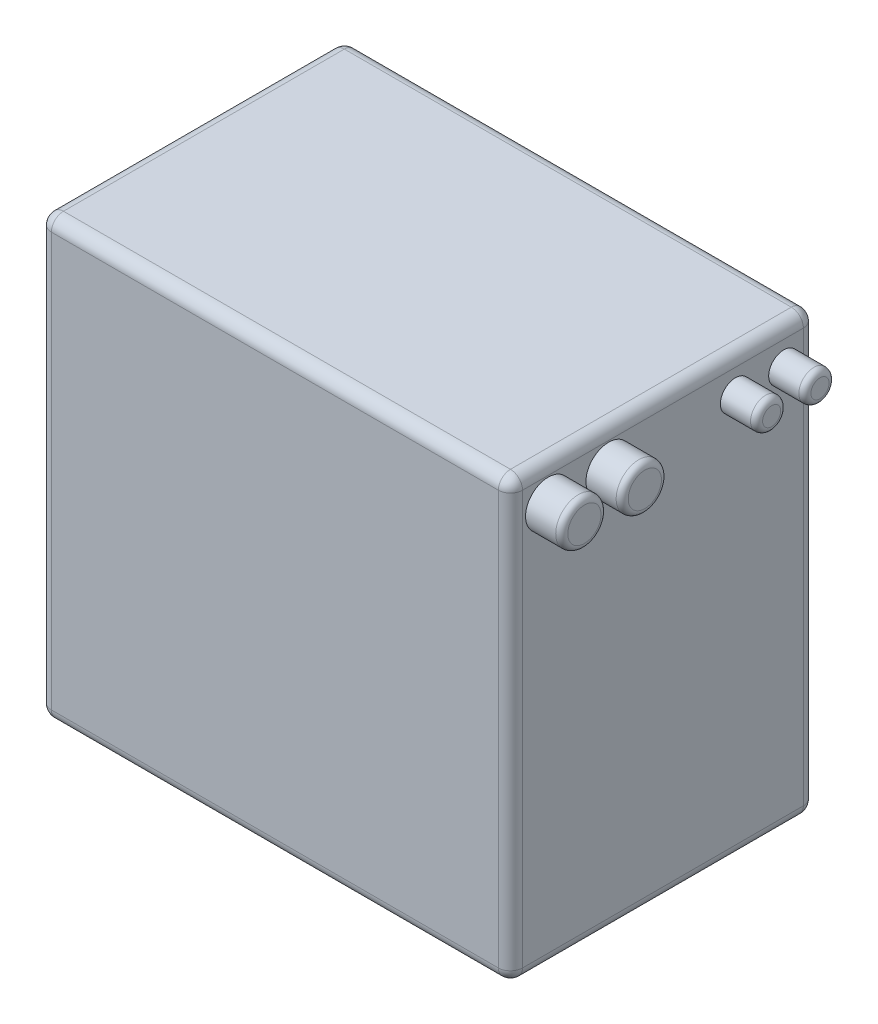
ISO-10303-21;
HEADER;
FILE_DESCRIPTION(('STEP AP214'),'2;1');
FILE_NAME('part.step','',(''),(''),'','','');
FILE_SCHEMA(('AUTOMOTIVE_DESIGN { 1 0 10303 214 1 1 1 1 }'));
ENDSEC;
DATA;
#1=APPLICATION_CONTEXT('core data for automotive mechanical design processes');
#2=APPLICATION_PROTOCOL_DEFINITION('international standard','automotive_design',2000,#1);
#3=PRODUCT_CONTEXT('',#1,'mechanical');
#4=PRODUCT('Part','Part','',(#3));
#5=PRODUCT_RELATED_PRODUCT_CATEGORY('part','',(#4));
#6=PRODUCT_DEFINITION_FORMATION('','',#4);
#7=PRODUCT_DEFINITION_CONTEXT('part definition',#1,'design');
#8=PRODUCT_DEFINITION('design','',#6,#7);
#9=PRODUCT_DEFINITION_SHAPE('','',#8);
#10=(LENGTH_UNIT() NAMED_UNIT(*) SI_UNIT(.MILLI.,.METRE.));
#11=(NAMED_UNIT(*) PLANE_ANGLE_UNIT() SI_UNIT($,.RADIAN.));
#12=(NAMED_UNIT(*) SI_UNIT($,.STERADIAN.) SOLID_ANGLE_UNIT());
#13=UNCERTAINTY_MEASURE_WITH_UNIT(LENGTH_MEASURE(1.E-05),#10,'distance_accuracy_value','');
#14=(GEOMETRIC_REPRESENTATION_CONTEXT(3) GLOBAL_UNCERTAINTY_ASSIGNED_CONTEXT((#13)) GLOBAL_UNIT_ASSIGNED_CONTEXT((#10,
#11,#12)) REPRESENTATION_CONTEXT('',''));
#15=CARTESIAN_POINT('',(0.,0.,0.));
#16=DIRECTION('',(0.,0.,1.));
#17=DIRECTION('',(1.,0.,0.));
#18=AXIS2_PLACEMENT_3D('',#15,#16,#17);
#19=CARTESIAN_POINT('',(266.7,211.1248,60.325));
#20=DIRECTION('',(-1.,0.,0.));
#21=DIRECTION('',(0.,0.,1.));
#22=AXIS2_PLACEMENT_3D('',#19,#20,#21);
#23=CYLINDRICAL_SURFACE('',#22,11.9126);
#24=CARTESIAN_POINT('',(263.525,211.1248,60.325));
#25=DIRECTION('',(1.,0.,0.));
#26=DIRECTION('',(0.,0.,-1.));
#27=AXIS2_PLACEMENT_3D('',#24,#25,#26);
#28=CIRCLE('',#27,11.9126);
#29=CARTESIAN_POINT('',(263.525,211.1248,72.2376));
#30=VERTEX_POINT('',#29);
#31=EDGE_CURVE('E11',#30,#30,#28,.F.);
#32=CARTESIAN_POINT('',(247.65,211.1248,60.325));
#33=DIRECTION('',(1.,0.,0.));
#34=DIRECTION('',(0.,0.,-1.));
#35=AXIS2_PLACEMENT_3D('',#32,#33,#34);
#36=CIRCLE('',#35,11.9126);
#37=CARTESIAN_POINT('',(247.65,211.1248,72.2376));
#38=VERTEX_POINT('',#37);
#39=EDGE_CURVE('E53',#38,#38,#36,.T.);
#40=CARTESIAN_POINT('',(263.525,211.1248,72.2376));
#41=CARTESIAN_POINT('',(263.359635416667,211.1248,72.2376));
#42=CARTESIAN_POINT('',(263.194270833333,211.1248,72.2376));
#43=CARTESIAN_POINT('',(262.863541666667,211.1248,72.2376));
#44=CARTESIAN_POINT('',(262.698177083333,211.1248,72.2376));
#45=CARTESIAN_POINT('',(262.367447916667,211.1248,72.2376));
#46=CARTESIAN_POINT('',(262.202083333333,211.1248,72.2376));
#47=CARTESIAN_POINT('',(261.871354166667,211.1248,72.2376));
#48=CARTESIAN_POINT('',(261.705989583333,211.1248,72.2376));
#49=CARTESIAN_POINT('',(261.375260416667,211.1248,72.2376));
#50=CARTESIAN_POINT('',(261.209895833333,211.1248,72.2376));
#51=CARTESIAN_POINT('',(260.879166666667,211.1248,72.2376));
#52=CARTESIAN_POINT('',(260.713802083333,211.1248,72.2376));
#53=CARTESIAN_POINT('',(260.383072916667,211.1248,72.2376));
#54=CARTESIAN_POINT('',(260.217708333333,211.1248,72.2376));
#55=CARTESIAN_POINT('',(259.886979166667,211.1248,72.2376));
#56=CARTESIAN_POINT('',(259.721614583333,211.1248,72.2376));
#57=CARTESIAN_POINT('',(259.390885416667,211.1248,72.2376));
#58=CARTESIAN_POINT('',(259.225520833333,211.1248,72.2376));
#59=CARTESIAN_POINT('',(258.894791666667,211.1248,72.2376));
#60=CARTESIAN_POINT('',(258.729427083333,211.1248,72.2376));
#61=CARTESIAN_POINT('',(258.398697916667,211.1248,72.2376));
#62=CARTESIAN_POINT('',(258.233333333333,211.1248,72.2376));
#63=CARTESIAN_POINT('',(257.902604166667,211.1248,72.2376));
#64=CARTESIAN_POINT('',(257.737239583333,211.1248,72.2376));
#65=CARTESIAN_POINT('',(257.406510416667,211.1248,72.2376));
#66=CARTESIAN_POINT('',(257.241145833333,211.1248,72.2376));
#67=CARTESIAN_POINT('',(256.910416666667,211.1248,72.2376));
#68=CARTESIAN_POINT('',(256.745052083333,211.1248,72.2376));
#69=CARTESIAN_POINT('',(256.414322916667,211.1248,72.2376));
#70=CARTESIAN_POINT('',(256.248958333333,211.1248,72.2376));
#71=CARTESIAN_POINT('',(255.918229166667,211.1248,72.2376));
#72=CARTESIAN_POINT('',(255.752864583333,211.1248,72.2376));
#73=CARTESIAN_POINT('',(255.422135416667,211.1248,72.2376));
#74=CARTESIAN_POINT('',(255.256770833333,211.1248,72.2376));
#75=CARTESIAN_POINT('',(254.926041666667,211.1248,72.2376));
#76=CARTESIAN_POINT('',(254.760677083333,211.1248,72.2376));
#77=CARTESIAN_POINT('',(254.429947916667,211.1248,72.2376));
#78=CARTESIAN_POINT('',(254.264583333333,211.1248,72.2376));
#79=CARTESIAN_POINT('',(253.933854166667,211.1248,72.2376));
#80=CARTESIAN_POINT('',(253.768489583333,211.1248,72.2376));
#81=CARTESIAN_POINT('',(253.437760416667,211.1248,72.2376));
#82=CARTESIAN_POINT('',(253.272395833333,211.1248,72.2376));
#83=CARTESIAN_POINT('',(252.941666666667,211.1248,72.2376));
#84=CARTESIAN_POINT('',(252.776302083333,211.1248,72.2376));
#85=CARTESIAN_POINT('',(252.445572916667,211.1248,72.2376));
#86=CARTESIAN_POINT('',(252.280208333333,211.1248,72.2376));
#87=CARTESIAN_POINT('',(251.949479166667,211.1248,72.2376));
#88=CARTESIAN_POINT('',(251.784114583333,211.1248,72.2376));
#89=CARTESIAN_POINT('',(251.453385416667,211.1248,72.2376));
#90=CARTESIAN_POINT('',(251.288020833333,211.1248,72.2376));
#91=CARTESIAN_POINT('',(250.957291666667,211.1248,72.2376));
#92=CARTESIAN_POINT('',(250.791927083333,211.1248,72.2376));
#93=CARTESIAN_POINT('',(250.461197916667,211.1248,72.2376));
#94=CARTESIAN_POINT('',(250.295833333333,211.1248,72.2376));
#95=CARTESIAN_POINT('',(249.965104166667,211.1248,72.2376));
#96=CARTESIAN_POINT('',(249.799739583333,211.1248,72.2376));
#97=CARTESIAN_POINT('',(249.469010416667,211.1248,72.2376));
#98=CARTESIAN_POINT('',(249.303645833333,211.1248,72.2376));
#99=CARTESIAN_POINT('',(248.972916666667,211.1248,72.2376));
#100=CARTESIAN_POINT('',(248.807552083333,211.1248,72.2376));
#101=CARTESIAN_POINT('',(248.476822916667,211.1248,72.2376));
#102=CARTESIAN_POINT('',(248.311458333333,211.1248,72.2376));
#103=CARTESIAN_POINT('',(247.980729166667,211.1248,72.2376));
#104=CARTESIAN_POINT('',(247.815364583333,211.1248,72.2376));
#105=CARTESIAN_POINT('',(247.65,211.1248,72.2376));
#106=B_SPLINE_CURVE_WITH_KNOTS('',3,(#40,#41,#42,#43,#44,#45,#46,#47,#48,#49,#50,#51,#52,#53,
#54,#55,#56,#57,#58,#59,#60,#61,#62,#63,#64,#65,#66,#67,#68,#69,#70,#71,#72,#73,#74,#75,#76,#77,
#78,#79,#80,#81,#82,#83,#84,#85,#86,#87,#88,#89,#90,#91,#92,#93,#94,#95,#96,#97,#98,#99,#100,
#101,#102,#103,#104,#105),.UNSPECIFIED.,.F.,.F.,(4,2,2,2,2,2,2,2,2,2,2,2,2,2,2,2,2,2,2,2,2,2,2,
2,2,2,2,2,2,2,2,2,4),(0.,0.496093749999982,0.992187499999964,1.48828125,1.98437499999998,
2.48046874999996,2.9765625,3.47265624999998,3.96874999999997,4.46484375,4.96093749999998,
5.45703124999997,5.953125,6.44921874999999,6.94531249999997,7.44140625,7.93749999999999,
8.43359374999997,8.92968750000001,9.42578124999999,9.92187499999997,10.41796875,10.9140625,
11.41015625,11.90625,12.40234375,12.8984375,13.39453125,13.890625,14.38671875,14.8828125,
15.37890625,15.875),.UNSPECIFIED.);
#107=EDGE_CURVE('BSEAM42',#30,#38,#106,.T.);
#108=ORIENTED_EDGE('',*,*,#31,.T.);
#109=ORIENTED_EDGE('',*,*,#39,.T.);
#110=ORIENTED_EDGE('',*,*,#107,.T.);
#111=ORIENTED_EDGE('',*,*,#107,.F.);
#112=EDGE_LOOP('',(#108,#110,#109,#111));
#113=FACE_BOUND('',#112,.T.);
#114=ADVANCED_FACE('F42',(#113),#23,.T.);
#115=CARTESIAN_POINT('',(266.7,211.1248,60.325));
#116=DIRECTION('',(1.,0.,0.));
#117=DIRECTION('',(0.,0.,-1.));
#118=AXIS2_PLACEMENT_3D('',#115,#116,#117);
#119=PLANE('',#118);
#120=CARTESIAN_POINT('',(266.7,211.1248,60.325));
#121=DIRECTION('',(1.,0.,0.));
#122=DIRECTION('',(0.,0.,-1.));
#123=AXIS2_PLACEMENT_3D('',#120,#121,#122);
#124=CIRCLE('',#123,8.73760000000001);
#125=CARTESIAN_POINT('',(266.7,211.1248,51.5874));
#126=VERTEX_POINT('',#125);
#127=EDGE_CURVE('E49',#126,#126,#124,.T.);
#128=ORIENTED_EDGE('',*,*,#127,.T.);
#129=EDGE_LOOP('',(#128));
#130=FACE_BOUND('',#129,.T.);
#131=ADVANCED_FACE('F63',(#130),#119,.T.);
#132=CARTESIAN_POINT('',(247.65,211.1248,60.325));
#133=DIRECTION('',(1.,0.,0.));
#134=DIRECTION('',(0.,0.,-1.));
#135=AXIS2_PLACEMENT_3D('',#132,#133,#134);
#136=PLANE('',#135);
#137=ORIENTED_EDGE('',*,*,#39,.F.);
#138=EDGE_LOOP('',(#137));
#139=FACE_BOUND('',#138,.T.);
#140=ADVANCED_FACE('F61',(#139),#136,.F.);
#141=CARTESIAN_POINT('',(263.525,211.1248,60.325));
#142=DIRECTION('',(1.,0.,0.));
#143=DIRECTION('',(0.,0.,-1.));
#144=AXIS2_PLACEMENT_3D('',#141,#142,#143);
#145=TOROIDAL_SURFACE('',#144,8.73760000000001,3.175);
#146=ORIENTED_EDGE('',*,*,#31,.F.);
#147=EDGE_LOOP('',(#146));
#148=FACE_BOUND('',#147,.T.);
#149=ORIENTED_EDGE('',*,*,#127,.F.);
#150=EDGE_LOOP('',(#149));
#151=FACE_BOUND('',#150,.T.);
#152=ADVANCED_FACE('F44',(#148,#151),#145,.T.);
#153=CLOSED_SHELL('',(#114,#131,#140,#152));
#154=MANIFOLD_SOLID_BREP('B2',#153);
#155=CARTESIAN_POINT('',(266.7,211.1248,28.575));
#156=DIRECTION('',(-1.,0.,0.));
#157=DIRECTION('',(0.,0.,1.));
#158=AXIS2_PLACEMENT_3D('',#155,#156,#157);
#159=CYLINDRICAL_SURFACE('',#158,11.9126);
#160=CARTESIAN_POINT('',(263.525,211.1248,28.575));
#161=DIRECTION('',(1.,0.,0.));
#162=DIRECTION('',(0.,0.,-1.));
#163=AXIS2_PLACEMENT_3D('',#160,#161,#162);
#164=CIRCLE('',#163,11.9126);
#165=CARTESIAN_POINT('',(263.525,211.1248,40.4876));
#166=VERTEX_POINT('',#165);
#167=EDGE_CURVE('E41',#166,#166,#164,.F.);
#168=CARTESIAN_POINT('',(247.65,211.1248,28.575));
#169=DIRECTION('',(1.,0.,0.));
#170=DIRECTION('',(0.,0.,-1.));
#171=AXIS2_PLACEMENT_3D('',#168,#169,#170);
#172=CIRCLE('',#171,11.9126);
#173=CARTESIAN_POINT('',(247.65,211.1248,40.4876));
#174=VERTEX_POINT('',#173);
#175=EDGE_CURVE('E129',#174,#174,#172,.T.);
#176=CARTESIAN_POINT('',(263.525,211.1248,40.4876));
#177=CARTESIAN_POINT('',(263.359635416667,211.1248,40.4876));
#178=CARTESIAN_POINT('',(263.194270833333,211.1248,40.4876));
#179=CARTESIAN_POINT('',(262.863541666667,211.1248,40.4876));
#180=CARTESIAN_POINT('',(262.698177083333,211.1248,40.4876));
#181=CARTESIAN_POINT('',(262.367447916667,211.1248,40.4876));
#182=CARTESIAN_POINT('',(262.202083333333,211.1248,40.4876));
#183=CARTESIAN_POINT('',(261.871354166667,211.1248,40.4876));
#184=CARTESIAN_POINT('',(261.705989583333,211.1248,40.4876));
#185=CARTESIAN_POINT('',(261.375260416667,211.1248,40.4876));
#186=CARTESIAN_POINT('',(261.209895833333,211.1248,40.4876));
#187=CARTESIAN_POINT('',(260.879166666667,211.1248,40.4876));
#188=CARTESIAN_POINT('',(260.713802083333,211.1248,40.4876));
#189=CARTESIAN_POINT('',(260.383072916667,211.1248,40.4876));
#190=CARTESIAN_POINT('',(260.217708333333,211.1248,40.4876));
#191=CARTESIAN_POINT('',(259.886979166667,211.1248,40.4876));
#192=CARTESIAN_POINT('',(259.721614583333,211.1248,40.4876));
#193=CARTESIAN_POINT('',(259.390885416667,211.1248,40.4876));
#194=CARTESIAN_POINT('',(259.225520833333,211.1248,40.4876));
#195=CARTESIAN_POINT('',(258.894791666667,211.1248,40.4876));
#196=CARTESIAN_POINT('',(258.729427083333,211.1248,40.4876));
#197=CARTESIAN_POINT('',(258.398697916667,211.1248,40.4876));
#198=CARTESIAN_POINT('',(258.233333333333,211.1248,40.4876));
#199=CARTESIAN_POINT('',(257.902604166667,211.1248,40.4876));
#200=CARTESIAN_POINT('',(257.737239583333,211.1248,40.4876));
#201=CARTESIAN_POINT('',(257.406510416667,211.1248,40.4876));
#202=CARTESIAN_POINT('',(257.241145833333,211.1248,40.4876));
#203=CARTESIAN_POINT('',(256.910416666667,211.1248,40.4876));
#204=CARTESIAN_POINT('',(256.745052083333,211.1248,40.4876));
#205=CARTESIAN_POINT('',(256.414322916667,211.1248,40.4876));
#206=CARTESIAN_POINT('',(256.248958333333,211.1248,40.4876));
#207=CARTESIAN_POINT('',(255.918229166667,211.1248,40.4876));
#208=CARTESIAN_POINT('',(255.752864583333,211.1248,40.4876));
#209=CARTESIAN_POINT('',(255.422135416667,211.1248,40.4876));
#210=CARTESIAN_POINT('',(255.256770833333,211.1248,40.4876));
#211=CARTESIAN_POINT('',(254.926041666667,211.1248,40.4876));
#212=CARTESIAN_POINT('',(254.760677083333,211.1248,40.4876));
#213=CARTESIAN_POINT('',(254.429947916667,211.1248,40.4876));
#214=CARTESIAN_POINT('',(254.264583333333,211.1248,40.4876));
#215=CARTESIAN_POINT('',(253.933854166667,211.1248,40.4876));
#216=CARTESIAN_POINT('',(253.768489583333,211.1248,40.4876));
#217=CARTESIAN_POINT('',(253.437760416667,211.1248,40.4876));
#218=CARTESIAN_POINT('',(253.272395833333,211.1248,40.4876));
#219=CARTESIAN_POINT('',(252.941666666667,211.1248,40.4876));
#220=CARTESIAN_POINT('',(252.776302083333,211.1248,40.4876));
#221=CARTESIAN_POINT('',(252.445572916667,211.1248,40.4876));
#222=CARTESIAN_POINT('',(252.280208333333,211.1248,40.4876));
#223=CARTESIAN_POINT('',(251.949479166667,211.1248,40.4876));
#224=CARTESIAN_POINT('',(251.784114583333,211.1248,40.4876));
#225=CARTESIAN_POINT('',(251.453385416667,211.1248,40.4876));
#226=CARTESIAN_POINT('',(251.288020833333,211.1248,40.4876));
#227=CARTESIAN_POINT('',(250.957291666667,211.1248,40.4876));
#228=CARTESIAN_POINT('',(250.791927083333,211.1248,40.4876));
#229=CARTESIAN_POINT('',(250.461197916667,211.1248,40.4876));
#230=CARTESIAN_POINT('',(250.295833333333,211.1248,40.4876));
#231=CARTESIAN_POINT('',(249.965104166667,211.1248,40.4876));
#232=CARTESIAN_POINT('',(249.799739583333,211.1248,40.4876));
#233=CARTESIAN_POINT('',(249.469010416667,211.1248,40.4876));
#234=CARTESIAN_POINT('',(249.303645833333,211.1248,40.4876));
#235=CARTESIAN_POINT('',(248.972916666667,211.1248,40.4876));
#236=CARTESIAN_POINT('',(248.807552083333,211.1248,40.4876));
#237=CARTESIAN_POINT('',(248.476822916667,211.1248,40.4876));
#238=CARTESIAN_POINT('',(248.311458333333,211.1248,40.4876));
#239=CARTESIAN_POINT('',(247.980729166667,211.1248,40.4876));
#240=CARTESIAN_POINT('',(247.815364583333,211.1248,40.4876));
#241=CARTESIAN_POINT('',(247.65,211.1248,40.4876));
#242=B_SPLINE_CURVE_WITH_KNOTS('',3,(#176,#177,#178,#179,#180,#181,#182,#183,#184,#185,#186,
#187,#188,#189,#190,#191,#192,#193,#194,#195,#196,#197,#198,#199,#200,#201,#202,#203,#204,#205,
#206,#207,#208,#209,#210,#211,#212,#213,#214,#215,#216,#217,#218,#219,#220,#221,#222,#223,#224,
#225,#226,#227,#228,#229,#230,#231,#232,#233,#234,#235,#236,#237,#238,#239,#240,#241),
.UNSPECIFIED.,.F.,.F.,(4,2,2,2,2,2,2,2,2,2,2,2,2,2,2,2,2,2,2,2,2,2,2,2,2,2,2,2,2,2,2,2,4),(0.,
0.496093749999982,0.992187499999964,1.48828125,1.98437499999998,2.48046874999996,2.9765625,
3.47265624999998,3.96874999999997,4.46484375,4.96093749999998,5.45703124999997,5.953125,
6.44921874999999,6.94531249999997,7.44140625,7.93749999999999,8.43359374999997,8.92968750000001,
9.42578124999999,9.92187499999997,10.41796875,10.9140625,11.41015625,11.90625,12.40234375,
12.8984375,13.39453125,13.890625,14.38671875,14.8828125,15.37890625,15.875),.UNSPECIFIED.);
#243=EDGE_CURVE('BSEAM118',#166,#174,#242,.T.);
#244=ORIENTED_EDGE('',*,*,#167,.T.);
#245=ORIENTED_EDGE('',*,*,#175,.T.);
#246=ORIENTED_EDGE('',*,*,#243,.T.);
#247=ORIENTED_EDGE('',*,*,#243,.F.);
#248=EDGE_LOOP('',(#244,#246,#245,#247));
#249=FACE_BOUND('',#248,.T.);
#250=ADVANCED_FACE('F118',(#249),#159,.T.);
#251=CARTESIAN_POINT('',(266.7,211.1248,28.575));
#252=DIRECTION('',(1.,0.,0.));
#253=DIRECTION('',(0.,0.,-1.));
#254=AXIS2_PLACEMENT_3D('',#251,#252,#253);
#255=PLANE('',#254);
#256=CARTESIAN_POINT('',(266.7,211.1248,28.575));
#257=DIRECTION('',(1.,0.,0.));
#258=DIRECTION('',(0.,0.,-1.));
#259=AXIS2_PLACEMENT_3D('',#256,#257,#258);
#260=CIRCLE('',#259,8.73760000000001);
#261=CARTESIAN_POINT('',(266.7,211.1248,19.8374));
#262=VERTEX_POINT('',#261);
#263=EDGE_CURVE('E125',#262,#262,#260,.T.);
#264=ORIENTED_EDGE('',*,*,#263,.T.);
#265=EDGE_LOOP('',(#264));
#266=FACE_BOUND('',#265,.T.);
#267=ADVANCED_FACE('F139',(#266),#255,.T.);
#268=CARTESIAN_POINT('',(247.65,211.1248,28.575));
#269=DIRECTION('',(1.,0.,0.));
#270=DIRECTION('',(0.,0.,-1.));
#271=AXIS2_PLACEMENT_3D('',#268,#269,#270);
#272=PLANE('',#271);
#273=ORIENTED_EDGE('',*,*,#175,.F.);
#274=EDGE_LOOP('',(#273));
#275=FACE_BOUND('',#274,.T.);
#276=ADVANCED_FACE('F137',(#275),#272,.F.);
#277=CARTESIAN_POINT('',(263.525,211.1248,28.575));
#278=DIRECTION('',(1.,0.,0.));
#279=DIRECTION('',(0.,0.,-1.));
#280=AXIS2_PLACEMENT_3D('',#277,#278,#279);
#281=TOROIDAL_SURFACE('',#280,8.73760000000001,3.175);
#282=ORIENTED_EDGE('',*,*,#167,.F.);
#283=EDGE_LOOP('',(#282));
#284=FACE_BOUND('',#283,.T.);
#285=ORIENTED_EDGE('',*,*,#263,.F.);
#286=EDGE_LOOP('',(#285));
#287=FACE_BOUND('',#286,.T.);
#288=ADVANCED_FACE('F120',(#284,#287),#281,.T.);
#289=CLOSED_SHELL('',(#250,#267,#276,#288));
#290=MANIFOLD_SOLID_BREP('B6',#289);
#291=CARTESIAN_POINT('',(266.7,211.1248,-38.1));
#292=DIRECTION('',(-1.,0.,0.));
#293=DIRECTION('',(0.,0.,1.));
#294=AXIS2_PLACEMENT_3D('',#291,#292,#293);
#295=CYLINDRICAL_SURFACE('',#294,7.9375);
#296=CARTESIAN_POINT('',(263.525,211.1248,-38.1));
#297=DIRECTION('',(1.,0.,0.));
#298=DIRECTION('',(0.,0.,-1.));
#299=AXIS2_PLACEMENT_3D('',#296,#297,#298);
#300=CIRCLE('',#299,7.9375);
#301=CARTESIAN_POINT('',(263.525,211.1248,-30.1625));
#302=VERTEX_POINT('',#301);
#303=EDGE_CURVE('E117',#302,#302,#300,.F.);
#304=CARTESIAN_POINT('',(247.65,211.1248,-38.1));
#305=DIRECTION('',(1.,0.,0.));
#306=DIRECTION('',(0.,0.,-1.));
#307=AXIS2_PLACEMENT_3D('',#304,#305,#306);
#308=CIRCLE('',#307,7.9375);
#309=CARTESIAN_POINT('',(247.65,211.1248,-30.1625));
#310=VERTEX_POINT('',#309);
#311=EDGE_CURVE('E205',#310,#310,#308,.T.);
#312=CARTESIAN_POINT('',(263.525,211.1248,-30.1625));
#313=CARTESIAN_POINT('',(263.359635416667,211.1248,-30.1625));
#314=CARTESIAN_POINT('',(263.194270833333,211.1248,-30.1625));
#315=CARTESIAN_POINT('',(262.863541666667,211.1248,-30.1625));
#316=CARTESIAN_POINT('',(262.698177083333,211.1248,-30.1625));
#317=CARTESIAN_POINT('',(262.367447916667,211.1248,-30.1625));
#318=CARTESIAN_POINT('',(262.202083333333,211.1248,-30.1625));
#319=CARTESIAN_POINT('',(261.871354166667,211.1248,-30.1625));
#320=CARTESIAN_POINT('',(261.705989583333,211.1248,-30.1625));
#321=CARTESIAN_POINT('',(261.375260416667,211.1248,-30.1625));
#322=CARTESIAN_POINT('',(261.209895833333,211.1248,-30.1625));
#323=CARTESIAN_POINT('',(260.879166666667,211.1248,-30.1625));
#324=CARTESIAN_POINT('',(260.713802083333,211.1248,-30.1625));
#325=CARTESIAN_POINT('',(260.383072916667,211.1248,-30.1625));
#326=CARTESIAN_POINT('',(260.217708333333,211.1248,-30.1625));
#327=CARTESIAN_POINT('',(259.886979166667,211.1248,-30.1625));
#328=CARTESIAN_POINT('',(259.721614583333,211.1248,-30.1625));
#329=CARTESIAN_POINT('',(259.390885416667,211.1248,-30.1625));
#330=CARTESIAN_POINT('',(259.225520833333,211.1248,-30.1625));
#331=CARTESIAN_POINT('',(258.894791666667,211.1248,-30.1625));
#332=CARTESIAN_POINT('',(258.729427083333,211.1248,-30.1625));
#333=CARTESIAN_POINT('',(258.398697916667,211.1248,-30.1625));
#334=CARTESIAN_POINT('',(258.233333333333,211.1248,-30.1625));
#335=CARTESIAN_POINT('',(257.902604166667,211.1248,-30.1625));
#336=CARTESIAN_POINT('',(257.737239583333,211.1248,-30.1625));
#337=CARTESIAN_POINT('',(257.406510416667,211.1248,-30.1625));
#338=CARTESIAN_POINT('',(257.241145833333,211.1248,-30.1625));
#339=CARTESIAN_POINT('',(256.910416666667,211.1248,-30.1625));
#340=CARTESIAN_POINT('',(256.745052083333,211.1248,-30.1625));
#341=CARTESIAN_POINT('',(256.414322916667,211.1248,-30.1625));
#342=CARTESIAN_POINT('',(256.248958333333,211.1248,-30.1625));
#343=CARTESIAN_POINT('',(255.918229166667,211.1248,-30.1625));
#344=CARTESIAN_POINT('',(255.752864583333,211.1248,-30.1625));
#345=CARTESIAN_POINT('',(255.422135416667,211.1248,-30.1625));
#346=CARTESIAN_POINT('',(255.256770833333,211.1248,-30.1625));
#347=CARTESIAN_POINT('',(254.926041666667,211.1248,-30.1625));
#348=CARTESIAN_POINT('',(254.760677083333,211.1248,-30.1625));
#349=CARTESIAN_POINT('',(254.429947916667,211.1248,-30.1625));
#350=CARTESIAN_POINT('',(254.264583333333,211.1248,-30.1625));
#351=CARTESIAN_POINT('',(253.933854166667,211.1248,-30.1625));
#352=CARTESIAN_POINT('',(253.768489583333,211.1248,-30.1625));
#353=CARTESIAN_POINT('',(253.437760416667,211.1248,-30.1625));
#354=CARTESIAN_POINT('',(253.272395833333,211.1248,-30.1625));
#355=CARTESIAN_POINT('',(252.941666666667,211.1248,-30.1625));
#356=CARTESIAN_POINT('',(252.776302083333,211.1248,-30.1625));
#357=CARTESIAN_POINT('',(252.445572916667,211.1248,-30.1625));
#358=CARTESIAN_POINT('',(252.280208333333,211.1248,-30.1625));
#359=CARTESIAN_POINT('',(251.949479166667,211.1248,-30.1625));
#360=CARTESIAN_POINT('',(251.784114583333,211.1248,-30.1625));
#361=CARTESIAN_POINT('',(251.453385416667,211.1248,-30.1625));
#362=CARTESIAN_POINT('',(251.288020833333,211.1248,-30.1625));
#363=CARTESIAN_POINT('',(250.957291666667,211.1248,-30.1625));
#364=CARTESIAN_POINT('',(250.791927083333,211.1248,-30.1625));
#365=CARTESIAN_POINT('',(250.461197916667,211.1248,-30.1625));
#366=CARTESIAN_POINT('',(250.295833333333,211.1248,-30.1625));
#367=CARTESIAN_POINT('',(249.965104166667,211.1248,-30.1625));
#368=CARTESIAN_POINT('',(249.799739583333,211.1248,-30.1625));
#369=CARTESIAN_POINT('',(249.469010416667,211.1248,-30.1625));
#370=CARTESIAN_POINT('',(249.303645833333,211.1248,-30.1625));
#371=CARTESIAN_POINT('',(248.972916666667,211.1248,-30.1625));
#372=CARTESIAN_POINT('',(248.807552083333,211.1248,-30.1625));
#373=CARTESIAN_POINT('',(248.476822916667,211.1248,-30.1625));
#374=CARTESIAN_POINT('',(248.311458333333,211.1248,-30.1625));
#375=CARTESIAN_POINT('',(247.980729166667,211.1248,-30.1625));
#376=CARTESIAN_POINT('',(247.815364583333,211.1248,-30.1625));
#377=CARTESIAN_POINT('',(247.65,211.1248,-30.1625));
#378=B_SPLINE_CURVE_WITH_KNOTS('',3,(#312,#313,#314,#315,#316,#317,#318,#319,#320,#321,#322,
#323,#324,#325,#326,#327,#328,#329,#330,#331,#332,#333,#334,#335,#336,#337,#338,#339,#340,#341,
#342,#343,#344,#345,#346,#347,#348,#349,#350,#351,#352,#353,#354,#355,#356,#357,#358,#359,#360,
#361,#362,#363,#364,#365,#366,#367,#368,#369,#370,#371,#372,#373,#374,#375,#376,#377),
.UNSPECIFIED.,.F.,.F.,(4,2,2,2,2,2,2,2,2,2,2,2,2,2,2,2,2,2,2,2,2,2,2,2,2,2,2,2,2,2,2,2,4),(0.,
0.496093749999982,0.992187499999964,1.48828125,1.98437499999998,2.48046874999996,2.9765625,
3.47265624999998,3.96874999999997,4.46484375,4.96093749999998,5.45703124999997,5.953125,
6.44921874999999,6.94531249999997,7.44140625,7.93749999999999,8.43359374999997,8.92968750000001,
9.42578124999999,9.92187499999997,10.41796875,10.9140625,11.41015625,11.90625,12.40234375,
12.8984375,13.39453125,13.890625,14.38671875,14.8828125,15.37890625,15.875),.UNSPECIFIED.);
#379=EDGE_CURVE('BSEAM194',#302,#310,#378,.T.);
#380=ORIENTED_EDGE('',*,*,#303,.T.);
#381=ORIENTED_EDGE('',*,*,#311,.T.);
#382=ORIENTED_EDGE('',*,*,#379,.T.);
#383=ORIENTED_EDGE('',*,*,#379,.F.);
#384=EDGE_LOOP('',(#380,#382,#381,#383));
#385=FACE_BOUND('',#384,.T.);
#386=ADVANCED_FACE('F194',(#385),#295,.T.);
#387=CARTESIAN_POINT('',(266.7,211.1248,-38.1));
#388=DIRECTION('',(1.,0.,0.));
#389=DIRECTION('',(0.,0.,-1.));
#390=AXIS2_PLACEMENT_3D('',#387,#388,#389);
#391=PLANE('',#390);
#392=CARTESIAN_POINT('',(266.7,211.1248,-38.1));
#393=DIRECTION('',(1.,0.,0.));
#394=DIRECTION('',(0.,0.,-1.));
#395=AXIS2_PLACEMENT_3D('',#392,#393,#394);
#396=CIRCLE('',#395,4.7625);
#397=CARTESIAN_POINT('',(266.7,211.1248,-42.8625));
#398=VERTEX_POINT('',#397);
#399=EDGE_CURVE('E201',#398,#398,#396,.T.);
#400=ORIENTED_EDGE('',*,*,#399,.T.);
#401=EDGE_LOOP('',(#400));
#402=FACE_BOUND('',#401,.T.);
#403=ADVANCED_FACE('F215',(#402),#391,.T.);
#404=CARTESIAN_POINT('',(247.65,211.1248,-38.1));
#405=DIRECTION('',(1.,0.,0.));
#406=DIRECTION('',(0.,0.,-1.));
#407=AXIS2_PLACEMENT_3D('',#404,#405,#406);
#408=PLANE('',#407);
#409=ORIENTED_EDGE('',*,*,#311,.F.);
#410=EDGE_LOOP('',(#409));
#411=FACE_BOUND('',#410,.T.);
#412=ADVANCED_FACE('F213',(#411),#408,.F.);
#413=CARTESIAN_POINT('',(263.525,211.1248,-38.1));
#414=DIRECTION('',(1.,0.,0.));
#415=DIRECTION('',(0.,0.,-1.));
#416=AXIS2_PLACEMENT_3D('',#413,#414,#415);
#417=TOROIDAL_SURFACE('',#416,4.7625,3.175);
#418=ORIENTED_EDGE('',*,*,#303,.F.);
#419=EDGE_LOOP('',(#418));
#420=FACE_BOUND('',#419,.T.);
#421=ORIENTED_EDGE('',*,*,#399,.F.);
#422=EDGE_LOOP('',(#421));
#423=FACE_BOUND('',#422,.T.);
#424=ADVANCED_FACE('F196',(#420,#423),#417,.T.);
#425=CLOSED_SHELL('',(#386,#403,#412,#424));
#426=MANIFOLD_SOLID_BREP('B36',#425);
#427=CARTESIAN_POINT('',(266.7,211.1248,-63.5));
#428=DIRECTION('',(-1.,0.,0.));
#429=DIRECTION('',(0.,0.,1.));
#430=AXIS2_PLACEMENT_3D('',#427,#428,#429);
#431=CYLINDRICAL_SURFACE('',#430,7.93749999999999);
#432=CARTESIAN_POINT('',(263.525,211.1248,-63.5));
#433=DIRECTION('',(1.,0.,0.));
#434=DIRECTION('',(0.,0.,-1.));
#435=AXIS2_PLACEMENT_3D('',#432,#433,#434);
#436=CIRCLE('',#435,7.93749999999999);
#437=CARTESIAN_POINT('',(263.525,211.1248,-55.5625));
#438=VERTEX_POINT('',#437);
#439=EDGE_CURVE('E193',#438,#438,#436,.F.);
#440=CARTESIAN_POINT('',(247.65,211.1248,-63.5));
#441=DIRECTION('',(1.,0.,0.));
#442=DIRECTION('',(0.,0.,-1.));
#443=AXIS2_PLACEMENT_3D('',#440,#441,#442);
#444=CIRCLE('',#443,7.93749999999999);
#445=CARTESIAN_POINT('',(247.65,211.1248,-55.5625));
#446=VERTEX_POINT('',#445);
#447=EDGE_CURVE('E282',#446,#446,#444,.T.);
#448=CARTESIAN_POINT('',(263.525,211.1248,-55.5625));
#449=CARTESIAN_POINT('',(263.359635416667,211.1248,-55.5625));
#450=CARTESIAN_POINT('',(263.194270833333,211.1248,-55.5625));
#451=CARTESIAN_POINT('',(262.863541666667,211.1248,-55.5625));
#452=CARTESIAN_POINT('',(262.698177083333,211.1248,-55.5625));
#453=CARTESIAN_POINT('',(262.367447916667,211.1248,-55.5625));
#454=CARTESIAN_POINT('',(262.202083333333,211.1248,-55.5625));
#455=CARTESIAN_POINT('',(261.871354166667,211.1248,-55.5625));
#456=CARTESIAN_POINT('',(261.705989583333,211.1248,-55.5625));
#457=CARTESIAN_POINT('',(261.375260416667,211.1248,-55.5625));
#458=CARTESIAN_POINT('',(261.209895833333,211.1248,-55.5625));
#459=CARTESIAN_POINT('',(260.879166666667,211.1248,-55.5625));
#460=CARTESIAN_POINT('',(260.713802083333,211.1248,-55.5625));
#461=CARTESIAN_POINT('',(260.383072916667,211.1248,-55.5625));
#462=CARTESIAN_POINT('',(260.217708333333,211.1248,-55.5625));
#463=CARTESIAN_POINT('',(259.886979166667,211.1248,-55.5625));
#464=CARTESIAN_POINT('',(259.721614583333,211.1248,-55.5625));
#465=CARTESIAN_POINT('',(259.390885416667,211.1248,-55.5625));
#466=CARTESIAN_POINT('',(259.225520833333,211.1248,-55.5625));
#467=CARTESIAN_POINT('',(258.894791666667,211.1248,-55.5625));
#468=CARTESIAN_POINT('',(258.729427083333,211.1248,-55.5625));
#469=CARTESIAN_POINT('',(258.398697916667,211.1248,-55.5625));
#470=CARTESIAN_POINT('',(258.233333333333,211.1248,-55.5625));
#471=CARTESIAN_POINT('',(257.902604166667,211.1248,-55.5625));
#472=CARTESIAN_POINT('',(257.737239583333,211.1248,-55.5625));
#473=CARTESIAN_POINT('',(257.406510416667,211.1248,-55.5625));
#474=CARTESIAN_POINT('',(257.241145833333,211.1248,-55.5625));
#475=CARTESIAN_POINT('',(256.910416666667,211.1248,-55.5625));
#476=CARTESIAN_POINT('',(256.745052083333,211.1248,-55.5625));
#477=CARTESIAN_POINT('',(256.414322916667,211.1248,-55.5625));
#478=CARTESIAN_POINT('',(256.248958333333,211.1248,-55.5625));
#479=CARTESIAN_POINT('',(255.918229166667,211.1248,-55.5625));
#480=CARTESIAN_POINT('',(255.752864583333,211.1248,-55.5625));
#481=CARTESIAN_POINT('',(255.422135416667,211.1248,-55.5625));
#482=CARTESIAN_POINT('',(255.256770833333,211.1248,-55.5625));
#483=CARTESIAN_POINT('',(254.926041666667,211.1248,-55.5625));
#484=CARTESIAN_POINT('',(254.760677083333,211.1248,-55.5625));
#485=CARTESIAN_POINT('',(254.429947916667,211.1248,-55.5625));
#486=CARTESIAN_POINT('',(254.264583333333,211.1248,-55.5625));
#487=CARTESIAN_POINT('',(253.933854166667,211.1248,-55.5625));
#488=CARTESIAN_POINT('',(253.768489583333,211.1248,-55.5625));
#489=CARTESIAN_POINT('',(253.437760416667,211.1248,-55.5625));
#490=CARTESIAN_POINT('',(253.272395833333,211.1248,-55.5625));
#491=CARTESIAN_POINT('',(252.941666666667,211.1248,-55.5625));
#492=CARTESIAN_POINT('',(252.776302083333,211.1248,-55.5625));
#493=CARTESIAN_POINT('',(252.445572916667,211.1248,-55.5625));
#494=CARTESIAN_POINT('',(252.280208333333,211.1248,-55.5625));
#495=CARTESIAN_POINT('',(251.949479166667,211.1248,-55.5625));
#496=CARTESIAN_POINT('',(251.784114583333,211.1248,-55.5625));
#497=CARTESIAN_POINT('',(251.453385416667,211.1248,-55.5625));
#498=CARTESIAN_POINT('',(251.288020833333,211.1248,-55.5625));
#499=CARTESIAN_POINT('',(250.957291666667,211.1248,-55.5625));
#500=CARTESIAN_POINT('',(250.791927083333,211.1248,-55.5625));
#501=CARTESIAN_POINT('',(250.461197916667,211.1248,-55.5625));
#502=CARTESIAN_POINT('',(250.295833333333,211.1248,-55.5625));
#503=CARTESIAN_POINT('',(249.965104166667,211.1248,-55.5625));
#504=CARTESIAN_POINT('',(249.799739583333,211.1248,-55.5625));
#505=CARTESIAN_POINT('',(249.469010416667,211.1248,-55.5625));
#506=CARTESIAN_POINT('',(249.303645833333,211.1248,-55.5625));
#507=CARTESIAN_POINT('',(248.972916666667,211.1248,-55.5625));
#508=CARTESIAN_POINT('',(248.807552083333,211.1248,-55.5625));
#509=CARTESIAN_POINT('',(248.476822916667,211.1248,-55.5625));
#510=CARTESIAN_POINT('',(248.311458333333,211.1248,-55.5625));
#511=CARTESIAN_POINT('',(247.980729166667,211.1248,-55.5625));
#512=CARTESIAN_POINT('',(247.815364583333,211.1248,-55.5625));
#513=CARTESIAN_POINT('',(247.65,211.1248,-55.5625));
#514=B_SPLINE_CURVE_WITH_KNOTS('',3,(#448,#449,#450,#451,#452,#453,#454,#455,#456,#457,#458,
#459,#460,#461,#462,#463,#464,#465,#466,#467,#468,#469,#470,#471,#472,#473,#474,#475,#476,#477,
#478,#479,#480,#481,#482,#483,#484,#485,#486,#487,#488,#489,#490,#491,#492,#493,#494,#495,#496,
#497,#498,#499,#500,#501,#502,#503,#504,#505,#506,#507,#508,#509,#510,#511,#512,#513),
.UNSPECIFIED.,.F.,.F.,(4,2,2,2,2,2,2,2,2,2,2,2,2,2,2,2,2,2,2,2,2,2,2,2,2,2,2,2,2,2,2,2,4),(0.,
0.496093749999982,0.992187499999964,1.48828125,1.98437499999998,2.48046874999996,2.9765625,
3.47265624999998,3.96874999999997,4.46484375,4.96093749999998,5.45703124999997,5.953125,
6.44921874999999,6.94531249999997,7.44140625,7.93749999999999,8.43359374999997,8.92968750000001,
9.42578124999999,9.92187499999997,10.41796875,10.9140625,11.41015625,11.90625,12.40234375,
12.8984375,13.39453125,13.890625,14.38671875,14.8828125,15.37890625,15.875),.UNSPECIFIED.);
#515=EDGE_CURVE('BSEAM271',#438,#446,#514,.T.);
#516=ORIENTED_EDGE('',*,*,#439,.T.);
#517=ORIENTED_EDGE('',*,*,#447,.T.);
#518=ORIENTED_EDGE('',*,*,#515,.T.);
#519=ORIENTED_EDGE('',*,*,#515,.F.);
#520=EDGE_LOOP('',(#516,#518,#517,#519));
#521=FACE_BOUND('',#520,.T.);
#522=ADVANCED_FACE('F271',(#521),#431,.T.);
#523=CARTESIAN_POINT('',(266.7,211.1248,-63.5));
#524=DIRECTION('',(1.,0.,0.));
#525=DIRECTION('',(0.,0.,-1.));
#526=AXIS2_PLACEMENT_3D('',#523,#524,#525);
#527=PLANE('',#526);
#528=CARTESIAN_POINT('',(266.7,211.1248,-63.5));
#529=DIRECTION('',(1.,0.,0.));
#530=DIRECTION('',(0.,0.,-1.));
#531=AXIS2_PLACEMENT_3D('',#528,#529,#530);
#532=CIRCLE('',#531,4.76249999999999);
#533=CARTESIAN_POINT('',(266.7,211.1248,-68.2625));
#534=VERTEX_POINT('',#533);
#535=EDGE_CURVE('E278',#534,#534,#532,.T.);
#536=ORIENTED_EDGE('',*,*,#535,.T.);
#537=EDGE_LOOP('',(#536));
#538=FACE_BOUND('',#537,.T.);
#539=ADVANCED_FACE('F292',(#538),#527,.T.);
#540=CARTESIAN_POINT('',(247.65,211.1248,-63.5));
#541=DIRECTION('',(1.,0.,0.));
#542=DIRECTION('',(0.,0.,-1.));
#543=AXIS2_PLACEMENT_3D('',#540,#541,#542);
#544=PLANE('',#543);
#545=ORIENTED_EDGE('',*,*,#447,.F.);
#546=EDGE_LOOP('',(#545));
#547=FACE_BOUND('',#546,.T.);
#548=ADVANCED_FACE('F290',(#547),#544,.F.);
#549=CARTESIAN_POINT('',(263.525,211.1248,-63.5));
#550=DIRECTION('',(1.,0.,0.));
#551=DIRECTION('',(0.,0.,-1.));
#552=AXIS2_PLACEMENT_3D('',#549,#550,#551);
#553=TOROIDAL_SURFACE('',#552,4.76249999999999,3.175);
#554=ORIENTED_EDGE('',*,*,#439,.F.);
#555=EDGE_LOOP('',(#554));
#556=FACE_BOUND('',#555,.T.);
#557=ORIENTED_EDGE('',*,*,#535,.F.);
#558=EDGE_LOOP('',(#557));
#559=FACE_BOUND('',#558,.T.);
#560=ADVANCED_FACE('F273',(#556,#559),#553,.T.);
#561=CLOSED_SHELL('',(#522,#539,#548,#560));
#562=MANIFOLD_SOLID_BREP('B112',#561);
#563=CARTESIAN_POINT('',(0.,230.1748,80.1624));
#564=DIRECTION('',(1.,0.,0.));
#565=DIRECTION('',(0.,1.,0.));
#566=AXIS2_PLACEMENT_3D('',#563,#564,#565);
#567=PLANE('',#566);
#568=DIRECTION('',(0.,0.,-1.));
#569=VECTOR('',#568,1.);
#570=CARTESIAN_POINT('',(0.,223.8248,80.1624));
#571=LINE('',#570,#569);
#572=CARTESIAN_POINT('',(0.,223.8248,73.8124));
#573=VERTEX_POINT('',#572);
#574=CARTESIAN_POINT('',(0.,223.8248,-73.8124));
#575=VERTEX_POINT('',#574);
#576=EDGE_CURVE('E471',#573,#575,#571,.T.);
#577=ORIENTED_EDGE('',*,*,#576,.T.);
#578=DIRECTION('',(0.,-1.,0.));
#579=VECTOR('',#578,1.);
#580=CARTESIAN_POINT('',(0.,230.1748,-73.8124));
#581=LINE('',#580,#579);
#582=CARTESIAN_POINT('',(0.,6.35,-73.8124));
#583=VERTEX_POINT('',#582);
#584=EDGE_CURVE('E476',#575,#583,#581,.T.);
#585=ORIENTED_EDGE('',*,*,#584,.T.);
#586=DIRECTION('',(0.,0.,-1.));
#587=VECTOR('',#586,1.);
#588=CARTESIAN_POINT('',(0.,6.34999999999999,80.1624));
#589=LINE('',#588,#587);
#590=CARTESIAN_POINT('',(0.,6.35,73.8124));
#591=VERTEX_POINT('',#590);
#592=EDGE_CURVE('E473',#583,#591,#589,.F.);
#593=ORIENTED_EDGE('',*,*,#592,.T.);
#594=DIRECTION('',(0.,-1.,0.));
#595=VECTOR('',#594,1.);
#596=CARTESIAN_POINT('',(0.,230.1748,73.8124));
#597=LINE('',#596,#595);
#598=EDGE_CURVE('E469',#591,#573,#597,.F.);
#599=ORIENTED_EDGE('',*,*,#598,.T.);
#600=EDGE_LOOP('',(#577,#585,#593,#599));
#601=FACE_BOUND('',#600,.T.);
#602=ADVANCED_FACE('F338',(#601),#567,.F.);
#603=CARTESIAN_POINT('',(0.,0.,80.1624));
#604=DIRECTION('',(0.,1.,0.));
#605=DIRECTION('',(0.,0.,1.));
#606=AXIS2_PLACEMENT_3D('',#603,#604,#605);
#607=PLANE('',#606);
#608=DIRECTION('',(0.,0.,-1.));
#609=VECTOR('',#608,1.);
#610=CARTESIAN_POINT('',(6.35,0.,80.1624));
#611=LINE('',#610,#609);
#612=CARTESIAN_POINT('',(6.35,0.,73.8124));
#613=VERTEX_POINT('',#612);
#614=CARTESIAN_POINT('',(6.35,0.,-73.8124));
#615=VERTEX_POINT('',#614);
#616=EDGE_CURVE('E437',#613,#615,#611,.T.);
#617=ORIENTED_EDGE('',*,*,#616,.T.);
#618=DIRECTION('',(1.,0.,0.));
#619=VECTOR('',#618,1.);
#620=CARTESIAN_POINT('',(0.,0.,-73.8124));
#621=LINE('',#620,#619);
#622=CARTESIAN_POINT('',(241.3,0.,-73.8124));
#623=VERTEX_POINT('',#622);
#624=EDGE_CURVE('E433',#615,#623,#621,.T.);
#625=ORIENTED_EDGE('',*,*,#624,.T.);
#626=DIRECTION('',(0.,0.,-1.));
#627=VECTOR('',#626,1.);
#628=CARTESIAN_POINT('',(241.3,0.,80.1624));
#629=LINE('',#628,#627);
#630=CARTESIAN_POINT('',(241.3,0.,73.8124));
#631=VERTEX_POINT('',#630);
#632=EDGE_CURVE('E425',#623,#631,#629,.F.);
#633=ORIENTED_EDGE('',*,*,#632,.T.);
#634=DIRECTION('',(1.,0.,0.));
#635=VECTOR('',#634,1.);
#636=CARTESIAN_POINT('',(0.,0.,73.8124));
#637=LINE('',#636,#635);
#638=EDGE_CURVE('E430',#631,#613,#637,.F.);
#639=ORIENTED_EDGE('',*,*,#638,.T.);
#640=EDGE_LOOP('',(#617,#625,#633,#639));
#641=FACE_BOUND('',#640,.T.);
#642=ADVANCED_FACE('F428',(#641),#607,.F.);
#643=CARTESIAN_POINT('',(247.65,0.,80.1624));
#644=DIRECTION('',(-1.,0.,0.));
#645=DIRECTION('',(0.,0.,1.));
#646=AXIS2_PLACEMENT_3D('',#643,#644,#645);
#647=PLANE('',#646);
#648=DIRECTION('',(0.,0.,-1.));
#649=VECTOR('',#648,1.);
#650=CARTESIAN_POINT('',(247.65,6.35,80.1624));
#651=LINE('',#650,#649);
#652=CARTESIAN_POINT('',(247.65,6.35,73.8124));
#653=VERTEX_POINT('',#652);
#654=CARTESIAN_POINT('',(247.65,6.35,-73.8124));
#655=VERTEX_POINT('',#654);
#656=EDGE_CURVE('E445',#653,#655,#651,.T.);
#657=ORIENTED_EDGE('',*,*,#656,.T.);
#658=DIRECTION('',(0.,1.,0.));
#659=VECTOR('',#658,1.);
#660=CARTESIAN_POINT('',(247.65,0.,-73.8124));
#661=LINE('',#660,#659);
#662=CARTESIAN_POINT('',(247.65,223.8248,-73.8124));
#663=VERTEX_POINT('',#662);
#664=EDGE_CURVE('E492',#655,#663,#661,.T.);
#665=ORIENTED_EDGE('',*,*,#664,.T.);
#666=DIRECTION('',(0.,0.,-1.));
#667=VECTOR('',#666,1.);
#668=CARTESIAN_POINT('',(247.65,223.8248,80.1624));
#669=LINE('',#668,#667);
#670=CARTESIAN_POINT('',(247.65,223.8248,73.8124));
#671=VERTEX_POINT('',#670);
#672=EDGE_CURVE('E489',#663,#671,#669,.F.);
#673=ORIENTED_EDGE('',*,*,#672,.T.);
#674=DIRECTION('',(0.,1.,0.));
#675=VECTOR('',#674,1.);
#676=CARTESIAN_POINT('',(247.65,0.,73.8124));
#677=LINE('',#676,#675);
#678=EDGE_CURVE('E487',#671,#653,#677,.F.);
#679=ORIENTED_EDGE('',*,*,#678,.T.);
#680=EDGE_LOOP('',(#657,#665,#673,#679));
#681=FACE_BOUND('',#680,.T.);
#682=ADVANCED_FACE('F601',(#681),#647,.F.);
#683=CARTESIAN_POINT('',(247.65,230.1748,80.1624));
#684=DIRECTION('',(0.,-1.,0.));
#685=DIRECTION('',(1.,0.,0.));
#686=AXIS2_PLACEMENT_3D('',#683,#684,#685);
#687=PLANE('',#686);
#688=DIRECTION('',(0.,0.,-1.));
#689=VECTOR('',#688,1.);
#690=CARTESIAN_POINT('',(241.3,230.1748,80.1624));
#691=LINE('',#690,#689);
#692=CARTESIAN_POINT('',(241.3,230.1748,73.8124));
#693=VERTEX_POINT('',#692);
#694=CARTESIAN_POINT('',(241.3,230.1748,-73.8124));
#695=VERTEX_POINT('',#694);
#696=EDGE_CURVE('E480',#693,#695,#691,.T.);
#697=ORIENTED_EDGE('',*,*,#696,.T.);
#698=DIRECTION('',(-1.,0.,0.));
#699=VECTOR('',#698,1.);
#700=CARTESIAN_POINT('',(247.65,230.1748,-73.8124));
#701=LINE('',#700,#699);
#702=CARTESIAN_POINT('',(6.34999999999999,230.1748,-73.8124));
#703=VERTEX_POINT('',#702);
#704=EDGE_CURVE('E485',#695,#703,#701,.T.);
#705=ORIENTED_EDGE('',*,*,#704,.T.);
#706=DIRECTION('',(0.,0.,-1.));
#707=VECTOR('',#706,1.);
#708=CARTESIAN_POINT('',(6.34999999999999,230.1748,80.1624));
#709=LINE('',#708,#707);
#710=CARTESIAN_POINT('',(6.34999999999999,230.1748,73.8124));
#711=VERTEX_POINT('',#710);
#712=EDGE_CURVE('E482',#703,#711,#709,.F.);
#713=ORIENTED_EDGE('',*,*,#712,.T.);
#714=DIRECTION('',(-1.,0.,0.));
#715=VECTOR('',#714,1.);
#716=CARTESIAN_POINT('',(247.65,230.1748,73.8124));
#717=LINE('',#716,#715);
#718=EDGE_CURVE('E478',#711,#693,#717,.F.);
#719=ORIENTED_EDGE('',*,*,#718,.T.);
#720=EDGE_LOOP('',(#697,#705,#713,#719));
#721=FACE_BOUND('',#720,.T.);
#722=ADVANCED_FACE('F578',(#721),#687,.F.);
#723=CARTESIAN_POINT('',(0.,0.,80.1624));
#724=DIRECTION('',(0.,0.,1.));
#725=DIRECTION('',(1.,0.,0.));
#726=AXIS2_PLACEMENT_3D('',#723,#724,#725);
#727=PLANE('',#726);
#728=DIRECTION('',(0.,1.,0.));
#729=VECTOR('',#728,1.);
#730=CARTESIAN_POINT('',(241.3,230.1748,80.1624));
#731=LINE('',#730,#729);
#732=CARTESIAN_POINT('',(241.3,6.35,80.1624));
#733=VERTEX_POINT('',#732);
#734=CARTESIAN_POINT('',(241.3,223.8248,80.1624));
#735=VERTEX_POINT('',#734);
#736=EDGE_CURVE('E347',#733,#735,#731,.T.);
#737=ORIENTED_EDGE('',*,*,#736,.T.);
#738=DIRECTION('',(-1.,0.,0.));
#739=VECTOR('',#738,1.);
#740=CARTESIAN_POINT('',(0.,223.8248,80.1624));
#741=LINE('',#740,#739);
#742=CARTESIAN_POINT('',(6.34999999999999,223.8248,80.1624));
#743=VERTEX_POINT('',#742);
#744=EDGE_CURVE('E269',#735,#743,#741,.T.);
#745=ORIENTED_EDGE('',*,*,#744,.T.);
#746=DIRECTION('',(0.,-1.,0.));
#747=VECTOR('',#746,1.);
#748=CARTESIAN_POINT('',(6.35,0.,80.1624));
#749=LINE('',#748,#747);
#750=CARTESIAN_POINT('',(6.35,6.35,80.1624));
#751=VERTEX_POINT('',#750);
#752=EDGE_CURVE('E503',#743,#751,#749,.T.);
#753=ORIENTED_EDGE('',*,*,#752,.T.);
#754=DIRECTION('',(1.,0.,0.));
#755=VECTOR('',#754,1.);
#756=CARTESIAN_POINT('',(247.65,6.35,80.1624));
#757=LINE('',#756,#755);
#758=EDGE_CURVE('E358',#751,#733,#757,.T.);
#759=ORIENTED_EDGE('',*,*,#758,.T.);
#760=EDGE_LOOP('',(#737,#745,#753,#759));
#761=FACE_BOUND('',#760,.T.);
#762=ADVANCED_FACE('F608',(#761),#727,.T.);
#763=CARTESIAN_POINT('',(0.,0.,-80.1624));
#764=DIRECTION('',(0.,0.,1.));
#765=DIRECTION('',(1.,0.,0.));
#766=AXIS2_PLACEMENT_3D('',#763,#764,#765);
#767=PLANE('',#766);
#768=DIRECTION('',(0.,1.,0.));
#769=VECTOR('',#768,1.);
#770=CARTESIAN_POINT('',(241.3,0.,-80.1624));
#771=LINE('',#770,#769);
#772=CARTESIAN_POINT('',(241.3,223.8248,-80.1624));
#773=VERTEX_POINT('',#772);
#774=CARTESIAN_POINT('',(241.3,6.35,-80.1624));
#775=VERTEX_POINT('',#774);
#776=EDGE_CURVE('E498',#773,#775,#771,.F.);
#777=ORIENTED_EDGE('',*,*,#776,.T.);
#778=DIRECTION('',(1.,0.,0.));
#779=VECTOR('',#778,1.);
#780=CARTESIAN_POINT('',(0.,6.35,-80.1624));
#781=LINE('',#780,#779);
#782=CARTESIAN_POINT('',(6.35,6.35,-80.1624));
#783=VERTEX_POINT('',#782);
#784=EDGE_CURVE('E500',#775,#783,#781,.F.);
#785=ORIENTED_EDGE('',*,*,#784,.T.);
#786=DIRECTION('',(0.,-1.,0.));
#787=VECTOR('',#786,1.);
#788=CARTESIAN_POINT('',(6.35,0.,-80.1624));
#789=LINE('',#788,#787);
#790=CARTESIAN_POINT('',(6.34999999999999,223.8248,-80.1624));
#791=VERTEX_POINT('',#790);
#792=EDGE_CURVE('E494',#783,#791,#789,.F.);
#793=ORIENTED_EDGE('',*,*,#792,.T.);
#794=DIRECTION('',(-1.,0.,0.));
#795=VECTOR('',#794,1.);
#796=CARTESIAN_POINT('',(0.,223.8248,-80.1624));
#797=LINE('',#796,#795);
#798=EDGE_CURVE('E496',#791,#773,#797,.F.);
#799=ORIENTED_EDGE('',*,*,#798,.T.);
#800=EDGE_LOOP('',(#777,#785,#793,#799));
#801=FACE_BOUND('',#800,.T.);
#802=ADVANCED_FACE('F569',(#801),#767,.F.);
#803=CARTESIAN_POINT('',(241.3,223.8248,80.1624));
#804=DIRECTION('',(0.,0.,-1.));
#805=DIRECTION('',(-1.,0.,0.));
#806=AXIS2_PLACEMENT_3D('',#803,#804,#805);
#807=CYLINDRICAL_SURFACE('',#806,6.35);
#808=CARTESIAN_POINT('',(241.3,223.8248,73.8124));
#809=DIRECTION('',(0.,0.,1.));
#810=DIRECTION('',(1.,0.,0.));
#811=AXIS2_PLACEMENT_3D('',#808,#809,#810);
#812=CIRCLE('',#811,6.35);
#813=EDGE_CURVE('E342',#671,#693,#812,.T.);
#814=ORIENTED_EDGE('',*,*,#813,.F.);
#815=ORIENTED_EDGE('',*,*,#672,.F.);
#816=CARTESIAN_POINT('',(241.3,223.8248,-73.8124));
#817=DIRECTION('',(0.,0.,-1.));
#818=DIRECTION('',(-1.,0.,0.));
#819=AXIS2_PLACEMENT_3D('',#816,#817,#818);
#820=CIRCLE('',#819,6.35);
#821=EDGE_CURVE('E465',#695,#663,#820,.T.);
#822=ORIENTED_EDGE('',*,*,#821,.F.);
#823=ORIENTED_EDGE('',*,*,#696,.F.);
#824=EDGE_LOOP('',(#814,#815,#822,#823));
#825=FACE_BOUND('',#824,.T.);
#826=ADVANCED_FACE('F340',(#825),#807,.T.);
#827=CARTESIAN_POINT('',(241.3,223.8248,73.8124));
#828=DIRECTION('',(0.,0.,1.));
#829=DIRECTION('',(1.,0.,0.));
#830=AXIS2_PLACEMENT_3D('',#827,#828,#829);
#831=SPHERICAL_SURFACE('',#830,6.35);
#832=CARTESIAN_POINT('',(241.3,223.8248,73.8124));
#833=DIRECTION('',(0.,1.,0.));
#834=DIRECTION('',(0.,0.,1.));
#835=AXIS2_PLACEMENT_3D('',#832,#833,#834);
#836=CIRCLE('',#835,6.35);
#837=EDGE_CURVE('E548',#671,#735,#836,.F.);
#838=ORIENTED_EDGE('',*,*,#837,.F.);
#839=ORIENTED_EDGE('',*,*,#813,.T.);
#840=CARTESIAN_POINT('',(241.3,223.8248,73.8124));
#841=DIRECTION('',(1.,0.,0.));
#842=DIRECTION('',(0.,0.,-1.));
#843=AXIS2_PLACEMENT_3D('',#840,#841,#842);
#844=CIRCLE('',#843,6.35);
#845=EDGE_CURVE('E550',#735,#693,#844,.F.);
#846=ORIENTED_EDGE('',*,*,#845,.F.);
#847=EDGE_LOOP('',(#838,#839,#846));
#848=FACE_BOUND('',#847,.T.);
#849=ADVANCED_FACE('F596',(#848),#831,.T.);
#850=CARTESIAN_POINT('',(241.3,223.8248,-73.8124));
#851=DIRECTION('',(0.,0.,1.));
#852=DIRECTION('',(1.,0.,0.));
#853=AXIS2_PLACEMENT_3D('',#850,#851,#852);
#854=SPHERICAL_SURFACE('',#853,6.35);
#855=CARTESIAN_POINT('',(241.3,223.8248,-73.8124));
#856=DIRECTION('',(1.,0.,0.));
#857=DIRECTION('',(0.,0.,-1.));
#858=AXIS2_PLACEMENT_3D('',#855,#856,#857);
#859=CIRCLE('',#858,6.35);
#860=EDGE_CURVE('E542',#695,#773,#859,.F.);
#861=ORIENTED_EDGE('',*,*,#860,.F.);
#862=ORIENTED_EDGE('',*,*,#821,.T.);
#863=CARTESIAN_POINT('',(241.3,223.8248,-73.8124));
#864=DIRECTION('',(0.,1.,0.));
#865=DIRECTION('',(0.,0.,1.));
#866=AXIS2_PLACEMENT_3D('',#863,#864,#865);
#867=CIRCLE('',#866,6.35);
#868=EDGE_CURVE('E545',#773,#663,#867,.F.);
#869=ORIENTED_EDGE('',*,*,#868,.F.);
#870=EDGE_LOOP('',(#861,#862,#869));
#871=FACE_BOUND('',#870,.T.);
#872=ADVANCED_FACE('F557',(#871),#854,.T.);
#873=CARTESIAN_POINT('',(0.,223.8248,73.8124));
#874=DIRECTION('',(1.,0.,0.));
#875=DIRECTION('',(0.,1.,0.));
#876=AXIS2_PLACEMENT_3D('',#873,#874,#875);
#877=CYLINDRICAL_SURFACE('',#876,6.35);
#878=ORIENTED_EDGE('',*,*,#845,.T.);
#879=ORIENTED_EDGE('',*,*,#718,.F.);
#880=CARTESIAN_POINT('',(6.34999999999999,223.8248,73.8124));
#881=DIRECTION('',(-1.,0.,0.));
#882=DIRECTION('',(0.,-1.,0.));
#883=AXIS2_PLACEMENT_3D('',#880,#881,#882);
#884=CIRCLE('',#883,6.35);
#885=EDGE_CURVE('E537',#743,#711,#884,.T.);
#886=ORIENTED_EDGE('',*,*,#885,.F.);
#887=ORIENTED_EDGE('',*,*,#744,.F.);
#888=EDGE_LOOP('',(#878,#879,#886,#887));
#889=FACE_BOUND('',#888,.T.);
#890=ADVANCED_FACE('F590',(#889),#877,.T.);
#891=CARTESIAN_POINT('',(241.3,0.,73.8124));
#892=DIRECTION('',(0.,-1.,0.));
#893=DIRECTION('',(0.,0.,-1.));
#894=AXIS2_PLACEMENT_3D('',#891,#892,#893);
#895=CYLINDRICAL_SURFACE('',#894,6.35);
#896=ORIENTED_EDGE('',*,*,#837,.T.);
#897=ORIENTED_EDGE('',*,*,#736,.F.);
#898=CARTESIAN_POINT('',(241.3,6.35,73.8124));
#899=DIRECTION('',(0.,-1.,0.));
#900=DIRECTION('',(0.,0.,-1.));
#901=AXIS2_PLACEMENT_3D('',#898,#899,#900);
#902=CIRCLE('',#901,6.35);
#903=EDGE_CURVE('E449',#653,#733,#902,.T.);
#904=ORIENTED_EDGE('',*,*,#903,.F.);
#905=ORIENTED_EDGE('',*,*,#678,.F.);
#906=EDGE_LOOP('',(#896,#897,#904,#905));
#907=FACE_BOUND('',#906,.T.);
#908=ADVANCED_FACE('F599',(#907),#895,.T.);
#909=CARTESIAN_POINT('',(241.3,6.35,80.1624));
#910=DIRECTION('',(0.,0.,-1.));
#911=DIRECTION('',(-1.,0.,0.));
#912=AXIS2_PLACEMENT_3D('',#909,#910,#911);
#913=CYLINDRICAL_SURFACE('',#912,6.35);
#914=CARTESIAN_POINT('',(241.3,6.35,-73.8124));
#915=DIRECTION('',(0.,0.,-1.));
#916=DIRECTION('',(-1.,0.,0.));
#917=AXIS2_PLACEMENT_3D('',#914,#915,#916);
#918=CIRCLE('',#917,6.35);
#919=EDGE_CURVE('E450',#655,#623,#918,.T.);
#920=ORIENTED_EDGE('',*,*,#919,.F.);
#921=ORIENTED_EDGE('',*,*,#656,.F.);
#922=CARTESIAN_POINT('',(241.3,6.35,73.8124));
#923=DIRECTION('',(0.,0.,1.));
#924=DIRECTION('',(1.,0.,0.));
#925=AXIS2_PLACEMENT_3D('',#922,#923,#924);
#926=CIRCLE('',#925,6.35);
#927=EDGE_CURVE('E441',#631,#653,#926,.T.);
#928=ORIENTED_EDGE('',*,*,#927,.F.);
#929=ORIENTED_EDGE('',*,*,#632,.F.);
#930=EDGE_LOOP('',(#920,#921,#928,#929));
#931=FACE_BOUND('',#930,.T.);
#932=ADVANCED_FACE('F443',(#931),#913,.T.);
#933=CARTESIAN_POINT('',(241.3,0.,-73.8124));
#934=DIRECTION('',(0.,1.,0.));
#935=DIRECTION('',(0.,0.,1.));
#936=AXIS2_PLACEMENT_3D('',#933,#934,#935);
#937=CYLINDRICAL_SURFACE('',#936,6.35);
#938=ORIENTED_EDGE('',*,*,#868,.T.);
#939=ORIENTED_EDGE('',*,*,#664,.F.);
#940=CARTESIAN_POINT('',(241.3,6.35,-73.8124));
#941=DIRECTION('',(0.,-1.,0.));
#942=DIRECTION('',(0.,0.,-1.));
#943=AXIS2_PLACEMENT_3D('',#940,#941,#942);
#944=CIRCLE('',#943,6.35);
#945=EDGE_CURVE('E533',#775,#655,#944,.T.);
#946=ORIENTED_EDGE('',*,*,#945,.F.);
#947=ORIENTED_EDGE('',*,*,#776,.F.);
#948=EDGE_LOOP('',(#938,#939,#946,#947));
#949=FACE_BOUND('',#948,.T.);
#950=ADVANCED_FACE('F565',(#949),#937,.T.);
#951=CARTESIAN_POINT('',(247.65,223.8248,-73.8124));
#952=DIRECTION('',(-1.,0.,0.));
#953=DIRECTION('',(0.,-1.,0.));
#954=AXIS2_PLACEMENT_3D('',#951,#952,#953);
#955=CYLINDRICAL_SURFACE('',#954,6.35);
#956=ORIENTED_EDGE('',*,*,#860,.T.);
#957=ORIENTED_EDGE('',*,*,#798,.F.);
#958=CARTESIAN_POINT('',(6.34999999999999,223.8248,-73.8124));
#959=DIRECTION('',(-1.,0.,0.));
#960=DIRECTION('',(0.,-1.,0.));
#961=AXIS2_PLACEMENT_3D('',#958,#959,#960);
#962=CIRCLE('',#961,6.35);
#963=EDGE_CURVE('E530',#703,#791,#962,.T.);
#964=ORIENTED_EDGE('',*,*,#963,.F.);
#965=ORIENTED_EDGE('',*,*,#704,.F.);
#966=EDGE_LOOP('',(#956,#957,#964,#965));
#967=FACE_BOUND('',#966,.T.);
#968=ADVANCED_FACE('F575',(#967),#955,.T.);
#969=CARTESIAN_POINT('',(6.34999999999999,223.8248,80.1624));
#970=DIRECTION('',(0.,0.,-1.));
#971=DIRECTION('',(-1.,0.,0.));
#972=AXIS2_PLACEMENT_3D('',#969,#970,#971);
#973=CYLINDRICAL_SURFACE('',#972,6.35);
#974=CARTESIAN_POINT('',(6.34999999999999,223.8248,73.8124));
#975=DIRECTION('',(0.,0.,1.));
#976=DIRECTION('',(1.,0.,0.));
#977=AXIS2_PLACEMENT_3D('',#974,#975,#976);
#978=CIRCLE('',#977,6.35);
#979=EDGE_CURVE('E539',#711,#573,#978,.T.);
#980=ORIENTED_EDGE('',*,*,#979,.F.);
#981=ORIENTED_EDGE('',*,*,#712,.F.);
#982=CARTESIAN_POINT('',(6.34999999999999,223.8248,-73.8124));
#983=DIRECTION('',(0.,0.,-1.));
#984=DIRECTION('',(-1.,0.,0.));
#985=AXIS2_PLACEMENT_3D('',#982,#983,#984);
#986=CIRCLE('',#985,6.35);
#987=EDGE_CURVE('E527',#575,#703,#986,.T.);
#988=ORIENTED_EDGE('',*,*,#987,.F.);
#989=ORIENTED_EDGE('',*,*,#576,.F.);
#990=EDGE_LOOP('',(#980,#981,#988,#989));
#991=FACE_BOUND('',#990,.T.);
#992=ADVANCED_FACE('F582',(#991),#973,.T.);
#993=CARTESIAN_POINT('',(6.34999999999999,223.8248,73.8124));
#994=DIRECTION('',(0.,0.,1.));
#995=DIRECTION('',(1.,0.,0.));
#996=AXIS2_PLACEMENT_3D('',#993,#994,#995);
#997=SPHERICAL_SURFACE('',#996,6.35);
#998=ORIENTED_EDGE('',*,*,#885,.T.);
#999=ORIENTED_EDGE('',*,*,#979,.T.);
#1000=CARTESIAN_POINT('',(6.34999999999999,223.8248,73.8124));
#1001=DIRECTION('',(0.,1.,0.));
#1002=DIRECTION('',(0.,0.,1.));
#1003=AXIS2_PLACEMENT_3D('',#1000,#1001,#1002);
#1004=CIRCLE('',#1003,6.35);
#1005=EDGE_CURVE('E456',#743,#573,#1004,.F.);
#1006=ORIENTED_EDGE('',*,*,#1005,.F.);
#1007=EDGE_LOOP('',(#998,#999,#1006));
#1008=FACE_BOUND('',#1007,.T.);
#1009=ADVANCED_FACE('F653',(#1008),#997,.T.);
#1010=CARTESIAN_POINT('',(241.3,6.35,73.8124));
#1011=DIRECTION('',(0.,0.,1.));
#1012=DIRECTION('',(1.,0.,0.));
#1013=AXIS2_PLACEMENT_3D('',#1010,#1011,#1012);
#1014=SPHERICAL_SURFACE('',#1013,6.35);
#1015=ORIENTED_EDGE('',*,*,#927,.T.);
#1016=ORIENTED_EDGE('',*,*,#903,.T.);
#1017=CARTESIAN_POINT('',(241.3,6.35,73.8124));
#1018=DIRECTION('',(1.,0.,0.));
#1019=DIRECTION('',(0.,0.,-1.));
#1020=AXIS2_PLACEMENT_3D('',#1017,#1018,#1019);
#1021=CIRCLE('',#1020,6.35);
#1022=EDGE_CURVE('E453',#631,#733,#1021,.F.);
#1023=ORIENTED_EDGE('',*,*,#1022,.F.);
#1024=EDGE_LOOP('',(#1015,#1016,#1023));
#1025=FACE_BOUND('',#1024,.T.);
#1026=ADVANCED_FACE('F454',(#1025),#1014,.T.);
#1027=CARTESIAN_POINT('',(241.3,6.35,-73.8124));
#1028=DIRECTION('',(0.,0.,1.));
#1029=DIRECTION('',(1.,0.,0.));
#1030=AXIS2_PLACEMENT_3D('',#1027,#1028,#1029);
#1031=SPHERICAL_SURFACE('',#1030,6.35);
#1032=ORIENTED_EDGE('',*,*,#945,.T.);
#1033=ORIENTED_EDGE('',*,*,#919,.T.);
#1034=CARTESIAN_POINT('',(241.3,6.35,-73.8124));
#1035=DIRECTION('',(1.,0.,0.));
#1036=DIRECTION('',(0.,0.,-1.));
#1037=AXIS2_PLACEMENT_3D('',#1034,#1035,#1036);
#1038=CIRCLE('',#1037,6.35);
#1039=EDGE_CURVE('E457',#775,#623,#1038,.F.);
#1040=ORIENTED_EDGE('',*,*,#1039,.F.);
#1041=EDGE_LOOP('',(#1032,#1033,#1040));
#1042=FACE_BOUND('',#1041,.T.);
#1043=ADVANCED_FACE('F646',(#1042),#1031,.T.);
#1044=CARTESIAN_POINT('',(6.34999999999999,223.8248,-73.8124));
#1045=DIRECTION('',(0.,0.,1.));
#1046=DIRECTION('',(1.,0.,0.));
#1047=AXIS2_PLACEMENT_3D('',#1044,#1045,#1046);
#1048=SPHERICAL_SURFACE('',#1047,6.35);
#1049=ORIENTED_EDGE('',*,*,#987,.T.);
#1050=ORIENTED_EDGE('',*,*,#963,.T.);
#1051=CARTESIAN_POINT('',(6.34999999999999,223.8248,-73.8124));
#1052=DIRECTION('',(0.,1.,0.));
#1053=DIRECTION('',(0.,0.,1.));
#1054=AXIS2_PLACEMENT_3D('',#1051,#1052,#1053);
#1055=CIRCLE('',#1054,6.35);
#1056=EDGE_CURVE('E520',#575,#791,#1055,.F.);
#1057=ORIENTED_EDGE('',*,*,#1056,.F.);
#1058=EDGE_LOOP('',(#1049,#1050,#1057));
#1059=FACE_BOUND('',#1058,.T.);
#1060=ADVANCED_FACE('F642',(#1059),#1048,.T.);
#1061=CARTESIAN_POINT('',(6.35,0.,73.8124));
#1062=DIRECTION('',(0.,1.,0.));
#1063=DIRECTION('',(-1.,0.,0.));
#1064=AXIS2_PLACEMENT_3D('',#1061,#1062,#1063);
#1065=CYLINDRICAL_SURFACE('',#1064,6.35);
#1066=ORIENTED_EDGE('',*,*,#1005,.T.);
#1067=ORIENTED_EDGE('',*,*,#598,.F.);
#1068=CARTESIAN_POINT('',(6.35,6.35,73.8124));
#1069=DIRECTION('',(0.,-1.,0.));
#1070=DIRECTION('',(0.,0.,-1.));
#1071=AXIS2_PLACEMENT_3D('',#1068,#1069,#1070);
#1072=CIRCLE('',#1071,6.35);
#1073=EDGE_CURVE('E517',#751,#591,#1072,.T.);
#1074=ORIENTED_EDGE('',*,*,#1073,.F.);
#1075=ORIENTED_EDGE('',*,*,#752,.F.);
#1076=EDGE_LOOP('',(#1066,#1067,#1074,#1075));
#1077=FACE_BOUND('',#1076,.T.);
#1078=ADVANCED_FACE('F639',(#1077),#1065,.T.);
#1079=CARTESIAN_POINT('',(0.,6.35,73.8124));
#1080=DIRECTION('',(-1.,0.,0.));
#1081=DIRECTION('',(0.,0.,1.));
#1082=AXIS2_PLACEMENT_3D('',#1079,#1080,#1081);
#1083=CYLINDRICAL_SURFACE('',#1082,6.35);
#1084=ORIENTED_EDGE('',*,*,#1022,.T.);
#1085=ORIENTED_EDGE('',*,*,#758,.F.);
#1086=CARTESIAN_POINT('',(6.35,6.35,73.8124));
#1087=DIRECTION('',(-1.,0.,0.));
#1088=DIRECTION('',(0.,0.,1.));
#1089=AXIS2_PLACEMENT_3D('',#1086,#1087,#1088);
#1090=CIRCLE('',#1089,6.35);
#1091=EDGE_CURVE('E461',#613,#751,#1090,.T.);
#1092=ORIENTED_EDGE('',*,*,#1091,.F.);
#1093=ORIENTED_EDGE('',*,*,#638,.F.);
#1094=EDGE_LOOP('',(#1084,#1085,#1092,#1093));
#1095=FACE_BOUND('',#1094,.T.);
#1096=ADVANCED_FACE('F459',(#1095),#1083,.T.);
#1097=CARTESIAN_POINT('',(0.,6.35,-73.8124));
#1098=DIRECTION('',(1.,0.,0.));
#1099=DIRECTION('',(0.,0.,-1.));
#1100=AXIS2_PLACEMENT_3D('',#1097,#1098,#1099);
#1101=CYLINDRICAL_SURFACE('',#1100,6.35);
#1102=ORIENTED_EDGE('',*,*,#1039,.T.);
#1103=ORIENTED_EDGE('',*,*,#624,.F.);
#1104=CARTESIAN_POINT('',(6.35,6.35,-73.8124));
#1105=DIRECTION('',(-1.,0.,0.));
#1106=DIRECTION('',(0.,0.,1.));
#1107=AXIS2_PLACEMENT_3D('',#1104,#1105,#1106);
#1108=CIRCLE('',#1107,6.35);
#1109=EDGE_CURVE('E513',#783,#615,#1108,.T.);
#1110=ORIENTED_EDGE('',*,*,#1109,.F.);
#1111=ORIENTED_EDGE('',*,*,#784,.F.);
#1112=EDGE_LOOP('',(#1102,#1103,#1110,#1111));
#1113=FACE_BOUND('',#1112,.T.);
#1114=ADVANCED_FACE('F632',(#1113),#1101,.T.);
#1115=CARTESIAN_POINT('',(6.34999999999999,230.1748,-73.8124));
#1116=DIRECTION('',(0.,-1.,0.));
#1117=DIRECTION('',(1.,0.,0.));
#1118=AXIS2_PLACEMENT_3D('',#1115,#1116,#1117);
#1119=CYLINDRICAL_SURFACE('',#1118,6.35);
#1120=ORIENTED_EDGE('',*,*,#1056,.T.);
#1121=ORIENTED_EDGE('',*,*,#792,.F.);
#1122=CARTESIAN_POINT('',(6.35,6.35,-73.8124));
#1123=DIRECTION('',(0.,-1.,0.));
#1124=DIRECTION('',(0.,0.,-1.));
#1125=AXIS2_PLACEMENT_3D('',#1122,#1123,#1124);
#1126=CIRCLE('',#1125,6.35);
#1127=EDGE_CURVE('E511',#583,#783,#1126,.T.);
#1128=ORIENTED_EDGE('',*,*,#1127,.F.);
#1129=ORIENTED_EDGE('',*,*,#584,.F.);
#1130=EDGE_LOOP('',(#1120,#1121,#1128,#1129));
#1131=FACE_BOUND('',#1130,.T.);
#1132=ADVANCED_FACE('F628',(#1131),#1119,.T.);
#1133=CARTESIAN_POINT('',(6.35,6.35,73.8124));
#1134=DIRECTION('',(0.,0.,1.));
#1135=DIRECTION('',(1.,0.,0.));
#1136=AXIS2_PLACEMENT_3D('',#1133,#1134,#1135);
#1137=SPHERICAL_SURFACE('',#1136,6.35);
#1138=ORIENTED_EDGE('',*,*,#1091,.T.);
#1139=ORIENTED_EDGE('',*,*,#1073,.T.);
#1140=CARTESIAN_POINT('',(6.35,6.35,73.8124));
#1141=DIRECTION('',(0.,0.,1.));
#1142=DIRECTION('',(1.,0.,0.));
#1143=AXIS2_PLACEMENT_3D('',#1140,#1141,#1142);
#1144=CIRCLE('',#1143,6.35);
#1145=EDGE_CURVE('E509',#613,#591,#1144,.F.);
#1146=ORIENTED_EDGE('',*,*,#1145,.F.);
#1147=EDGE_LOOP('',(#1138,#1139,#1146));
#1148=FACE_BOUND('',#1147,.T.);
#1149=ADVANCED_FACE('F624',(#1148),#1137,.T.);
#1150=CARTESIAN_POINT('',(6.35,6.35,-73.8124));
#1151=DIRECTION('',(0.,0.,1.));
#1152=DIRECTION('',(1.,0.,0.));
#1153=AXIS2_PLACEMENT_3D('',#1150,#1151,#1152);
#1154=SPHERICAL_SURFACE('',#1153,6.35);
#1155=ORIENTED_EDGE('',*,*,#1127,.T.);
#1156=ORIENTED_EDGE('',*,*,#1109,.T.);
#1157=CARTESIAN_POINT('',(6.35,6.35,-73.8124));
#1158=DIRECTION('',(0.,0.,-1.));
#1159=DIRECTION('',(-1.,0.,0.));
#1160=AXIS2_PLACEMENT_3D('',#1157,#1158,#1159);
#1161=CIRCLE('',#1160,6.35);
#1162=EDGE_CURVE('E507',#583,#615,#1161,.F.);
#1163=ORIENTED_EDGE('',*,*,#1162,.F.);
#1164=EDGE_LOOP('',(#1155,#1156,#1163));
#1165=FACE_BOUND('',#1164,.T.);
#1166=ADVANCED_FACE('F620',(#1165),#1154,.T.);
#1167=CARTESIAN_POINT('',(6.35,6.35,80.1624));
#1168=DIRECTION('',(0.,0.,-1.));
#1169=DIRECTION('',(-1.,0.,0.));
#1170=AXIS2_PLACEMENT_3D('',#1167,#1168,#1169);
#1171=CYLINDRICAL_SURFACE('',#1170,6.35);
#1172=ORIENTED_EDGE('',*,*,#1145,.T.);
#1173=ORIENTED_EDGE('',*,*,#592,.F.);
#1174=ORIENTED_EDGE('',*,*,#1162,.T.);
#1175=ORIENTED_EDGE('',*,*,#616,.F.);
#1176=EDGE_LOOP('',(#1172,#1173,#1174,#1175));
#1177=FACE_BOUND('',#1176,.T.);
#1178=ADVANCED_FACE('F617',(#1177),#1171,.T.);
#1179=CLOSED_SHELL('',(#602,#642,#682,#722,#762,#802,#826,#849,#872,#890,#908,#932,#950,#968,
#992,#1009,#1026,#1043,#1060,#1078,#1096,#1114,#1132,#1149,#1166,#1178));
#1180=MANIFOLD_SOLID_BREP('B188',#1179);
#1181=ADVANCED_BREP_SHAPE_REPRESENTATION('',(#18,#154,#290,#426,#562,#1180),#14);
#1182=SHAPE_DEFINITION_REPRESENTATION(#9,#1181);
ENDSEC;
END-ISO-10303-21;
